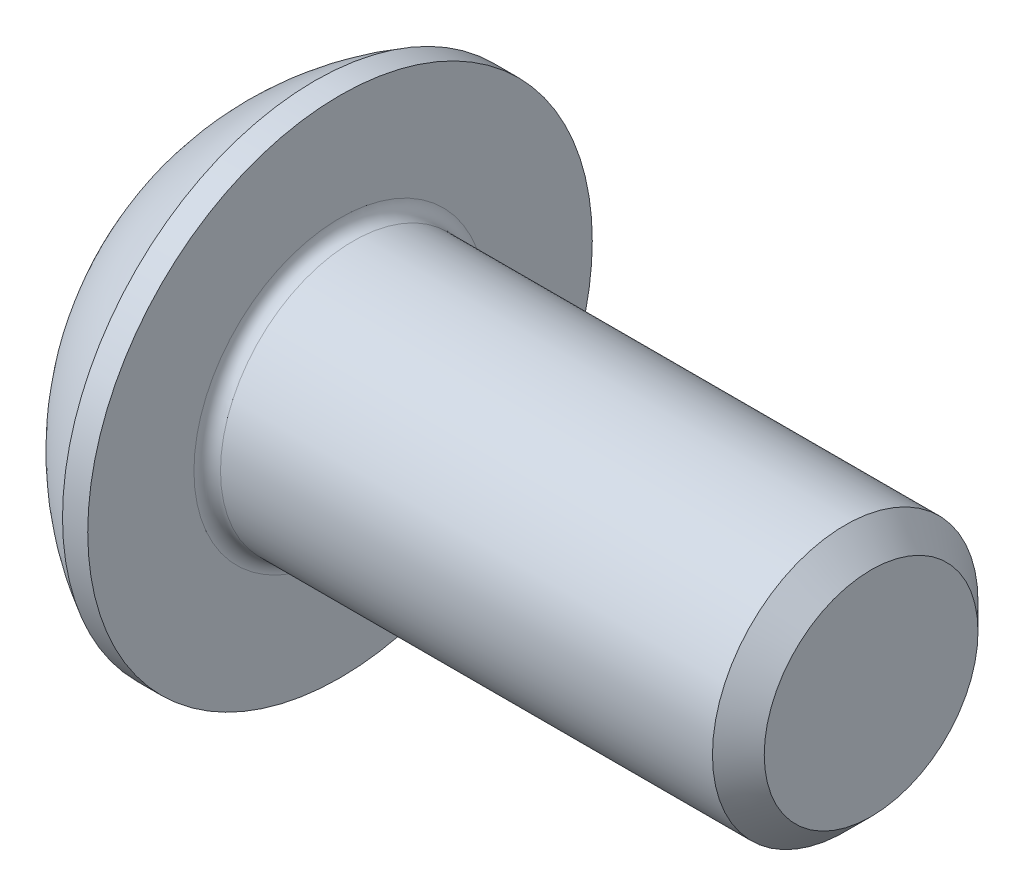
ISO-10303-21;
HEADER;
FILE_DESCRIPTION(('STEP AP214'),'2;1');
FILE_NAME('part.step','',(''),(''),'','','');
FILE_SCHEMA(('AUTOMOTIVE_DESIGN { 1 0 10303 214 1 1 1 1 }'));
ENDSEC;
DATA;
#1=APPLICATION_CONTEXT('core data for automotive mechanical design processes');
#2=APPLICATION_PROTOCOL_DEFINITION('international standard','automotive_design',2000,#1);
#3=PRODUCT_CONTEXT('',#1,'mechanical');
#4=PRODUCT('Part','Part','',(#3));
#5=PRODUCT_RELATED_PRODUCT_CATEGORY('part','',(#4));
#6=PRODUCT_DEFINITION_FORMATION('','',#4);
#7=PRODUCT_DEFINITION_CONTEXT('part definition',#1,'design');
#8=PRODUCT_DEFINITION('design','',#6,#7);
#9=PRODUCT_DEFINITION_SHAPE('','',#8);
#10=(LENGTH_UNIT() NAMED_UNIT(*) SI_UNIT(.MILLI.,.METRE.));
#11=(NAMED_UNIT(*) PLANE_ANGLE_UNIT() SI_UNIT($,.RADIAN.));
#12=(NAMED_UNIT(*) SI_UNIT($,.STERADIAN.) SOLID_ANGLE_UNIT());
#13=UNCERTAINTY_MEASURE_WITH_UNIT(LENGTH_MEASURE(1.E-05),#10,'distance_accuracy_value','');
#14=(GEOMETRIC_REPRESENTATION_CONTEXT(3) GLOBAL_UNCERTAINTY_ASSIGNED_CONTEXT((#13)) GLOBAL_UNIT_ASSIGNED_CONTEXT((#10,
#11,#12)) REPRESENTATION_CONTEXT('',''));
#15=CARTESIAN_POINT('',(0.,0.,0.));
#16=DIRECTION('',(0.,0.,1.));
#17=DIRECTION('',(1.,0.,0.));
#18=AXIS2_PLACEMENT_3D('',#15,#16,#17);
#19=CARTESIAN_POINT('',(0.,0.,0.));
#20=DIRECTION('',(-1.,0.,0.));
#21=DIRECTION('',(0.,0.,1.));
#22=AXIS2_PLACEMENT_3D('',#19,#20,#21);
#23=PLANE('',#22);
#24=CARTESIAN_POINT('',(0.,0.,0.));
#25=DIRECTION('',(-1.,0.,0.));
#26=DIRECTION('',(0.,0.,1.));
#27=AXIS2_PLACEMENT_3D('',#24,#25,#26);
#28=CIRCLE('',#27,1.9);
#29=CARTESIAN_POINT('',(0.,1.9,0.));
#30=VERTEX_POINT('',#29);
#31=EDGE_CURVE('E157',#30,#30,#28,.T.);
#32=ORIENTED_EDGE('',*,*,#31,.T.);
#33=EDGE_LOOP('',(#32));
#34=FACE_BOUND('',#33,.T.);
#35=DIRECTION('',(0.,-1.,0.));
#36=VECTOR('',#35,1.);
#37=CARTESIAN_POINT('',(0.,-0.721687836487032,1.25));
#38=LINE('',#37,#36);
#39=CARTESIAN_POINT('',(0.,0.721687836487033,1.25));
#40=VERTEX_POINT('',#39);
#41=CARTESIAN_POINT('',(0.,-0.721687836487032,1.25));
#42=VERTEX_POINT('',#41);
#43=EDGE_CURVE('E52',#40,#42,#38,.T.);
#44=ORIENTED_EDGE('',*,*,#43,.T.);
#45=DIRECTION('',(0.,-0.5,-0.866025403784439));
#46=VECTOR('',#45,1.);
#47=CARTESIAN_POINT('',(0.,-1.44337567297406,0.));
#48=LINE('',#47,#46);
#49=CARTESIAN_POINT('',(0.,-1.44337567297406,0.));
#50=VERTEX_POINT('',#49);
#51=EDGE_CURVE('E277',#42,#50,#48,.T.);
#52=ORIENTED_EDGE('',*,*,#51,.T.);
#53=DIRECTION('',(0.,0.5,-0.866025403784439));
#54=VECTOR('',#53,1.);
#55=CARTESIAN_POINT('',(0.,-0.721687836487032,-1.25));
#56=LINE('',#55,#54);
#57=CARTESIAN_POINT('',(0.,-0.721687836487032,-1.25));
#58=VERTEX_POINT('',#57);
#59=EDGE_CURVE('E132',#50,#58,#56,.T.);
#60=ORIENTED_EDGE('',*,*,#59,.T.);
#61=DIRECTION('',(0.,1.,0.));
#62=VECTOR('',#61,1.);
#63=CARTESIAN_POINT('',(0.,0.721687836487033,-1.25));
#64=LINE('',#63,#62);
#65=CARTESIAN_POINT('',(0.,0.721687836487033,-1.25));
#66=VERTEX_POINT('',#65);
#67=EDGE_CURVE('E280',#58,#66,#64,.T.);
#68=ORIENTED_EDGE('',*,*,#67,.T.);
#69=DIRECTION('',(0.,0.5,0.866025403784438));
#70=VECTOR('',#69,1.);
#71=CARTESIAN_POINT('',(0.,1.44337567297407,0.));
#72=LINE('',#71,#70);
#73=CARTESIAN_POINT('',(0.,1.44337567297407,0.));
#74=VERTEX_POINT('',#73);
#75=EDGE_CURVE('E282',#66,#74,#72,.T.);
#76=ORIENTED_EDGE('',*,*,#75,.T.);
#77=DIRECTION('',(0.,-0.5,0.866025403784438));
#78=VECTOR('',#77,1.);
#79=CARTESIAN_POINT('',(0.,0.721687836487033,1.25));
#80=LINE('',#79,#78);
#81=EDGE_CURVE('E284',#74,#40,#80,.T.);
#82=ORIENTED_EDGE('',*,*,#81,.T.);
#83=EDGE_LOOP('',(#44,#52,#60,#68,#76,#82));
#84=FACE_BOUND('',#83,.T.);
#85=ADVANCED_FACE('F37',(#34,#84),#23,.T.);
#86=CARTESIAN_POINT('',(3.88527472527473,0.,0.));
#87=DIRECTION('',(-1.,0.,0.));
#88=DIRECTION('',(0.,1.,0.));
#89=AXIS2_PLACEMENT_3D('',#86,#87,#88);
#90=SPHERICAL_SURFACE('',#89,4.32496932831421);
#91=CARTESIAN_POINT('',(1.82,0.,0.));
#92=DIRECTION('',(-1.,0.,0.));
#93=DIRECTION('',(0.,0.,1.));
#94=AXIS2_PLACEMENT_3D('',#91,#92,#93);
#95=CIRCLE('',#94,3.8);
#96=CARTESIAN_POINT('',(1.82,3.8,0.));
#97=VERTEX_POINT('',#96);
#98=EDGE_CURVE('E154',#97,#97,#95,.T.);
#99=CARTESIAN_POINT('',(1.82,3.8,0.));
#100=CARTESIAN_POINT('',(1.79553223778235,3.78670197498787,0.));
#101=CARTESIAN_POINT('',(1.77119294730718,3.77316757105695,0.));
#102=CARTESIAN_POINT('',(1.72278031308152,3.74563119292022,0.));
#103=CARTESIAN_POINT('',(1.69870696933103,3.7316292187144,0.));
#104=CARTESIAN_POINT('',(1.65083523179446,3.7031628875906,0.));
#105=CARTESIAN_POINT('',(1.62703683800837,3.6886985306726,0.));
#106=CARTESIAN_POINT('',(1.57972387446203,3.65931284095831,0.));
#107=CARTESIAN_POINT('',(1.55620930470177,3.64439150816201,0.));
#108=CARTESIAN_POINT('',(1.50947276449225,3.61409743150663,0.));
#109=CARTESIAN_POINT('',(1.48625079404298,3.59872468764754,0.));
#110=CARTESIAN_POINT('',(1.44010811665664,3.56753352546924,0.));
#111=CARTESIAN_POINT('',(1.41718740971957,3.55171510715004,0.));
#112=CARTESIAN_POINT('',(1.37165581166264,3.51963849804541,0.));
#113=CARTESIAN_POINT('',(1.34904492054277,3.50338030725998,0.));
#114=CARTESIAN_POINT('',(1.30414139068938,3.47043021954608,0.));
#115=CARTESIAN_POINT('',(1.28184875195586,3.4537383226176,0.));
#116=CARTESIAN_POINT('',(1.23759004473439,3.41992705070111,0.));
#117=CARTESIAN_POINT('',(1.21562397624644,3.40280767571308,0.));
#118=CARTESIAN_POINT('',(1.17202660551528,3.3681478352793,0.));
#119=CARTESIAN_POINT('',(1.15039530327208,3.35060736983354,0.));
#120=CARTESIAN_POINT('',(1.10747553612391,3.31511189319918,0.));
#121=CARTESIAN_POINT('',(1.08618707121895,3.29715688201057,0.));
#122=CARTESIAN_POINT('',(1.04396092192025,3.26083901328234,0.));
#123=CARTESIAN_POINT('',(1.02302323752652,3.24247615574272,0.));
#124=CARTESIAN_POINT('',(0.981506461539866,3.20534944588,0.));
#125=CARTESIAN_POINT('',(0.960927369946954,3.18658559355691,0.));
#126=CARTESIAN_POINT('',(0.920135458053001,3.14866389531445,0.));
#127=CARTESIAN_POINT('',(0.89992263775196,3.12950604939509,0.));
#128=CARTESIAN_POINT('',(0.859870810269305,3.09080351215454,0.));
#129=CARTESIAN_POINT('',(0.840031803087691,3.07125882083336,0.));
#130=CARTESIAN_POINT('',(0.800735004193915,3.0317898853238,0.));
#131=CARTESIAN_POINT('',(0.781277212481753,3.01186564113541,0.));
#132=CARTESIAN_POINT('',(0.742750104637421,2.97164503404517,0.));
#133=CARTESIAN_POINT('',(0.723680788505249,2.95134867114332,0.));
#134=CARTESIAN_POINT('',(0.685937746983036,2.91039139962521,0.));
#135=CARTESIAN_POINT('',(0.667264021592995,2.88973049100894,0.));
#136=CARTESIAN_POINT('',(0.630319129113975,2.84805183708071,0.));
#137=CARTESIAN_POINT('',(0.612047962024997,2.82703409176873,0.));
#138=CARTESIAN_POINT('',(0.575915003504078,2.78464960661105,0.));
#139=CARTESIAN_POINT('',(0.558053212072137,2.76328286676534,0.));
#140=CARTESIAN_POINT('',(0.52274566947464,2.72020836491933,0.));
#141=CARTESIAN_POINT('',(0.505299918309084,2.69850060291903,0.));
#142=CARTESIAN_POINT('',(0.470830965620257,2.65475215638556,0.));
#143=CARTESIAN_POINT('',(0.453807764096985,2.63271147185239,0.));
#144=CARTESIAN_POINT('',(0.420190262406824,2.58830540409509,0.));
#145=CARTESIAN_POINT('',(0.403595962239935,2.56594002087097,0.));
#146=CARTESIAN_POINT('',(0.370842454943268,2.52089290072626,0.));
#147=CARTESIAN_POINT('',(0.35468324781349,2.49821116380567,0.));
#148=CARTESIAN_POINT('',(0.322805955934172,2.45253979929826,0.));
#149=CARTESIAN_POINT('',(0.307087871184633,2.42955017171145,0.));
#150=CARTESIAN_POINT('',(0.276098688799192,2.38327160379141,0.));
#151=CARTESIAN_POINT('',(0.260827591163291,2.35998266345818,0.));
#152=CARTESIAN_POINT('',(0.230738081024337,2.31311415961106,0.));
#153=CARTESIAN_POINT('',(0.215919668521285,2.28953459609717,0.));
#154=CARTESIAN_POINT('',(0.186741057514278,2.24209364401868,0.));
#155=CARTESIAN_POINT('',(0.172380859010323,2.21823225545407,0.));
#156=CARTESIAN_POINT('',(0.14412403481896,2.17023655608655,0.));
#157=CARTESIAN_POINT('',(0.130227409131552,2.14610224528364,0.));
#158=CARTESIAN_POINT('',(0.102902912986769,2.09756970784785,0.));
#159=CARTESIAN_POINT('',(0.0894750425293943,2.07317148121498,0.));
#160=CARTESIAN_POINT('',(0.0630930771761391,2.02412021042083,0.));
#161=CARTESIAN_POINT('',(0.0501389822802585,1.99946716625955,0.));
#162=CARTESIAN_POINT('',(0.0247093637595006,1.94991547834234,0.));
#163=CARTESIAN_POINT('',(0.0122338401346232,1.9250168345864,0.));
#164=CARTESIAN_POINT('',(0.,1.9,0.));
#165=B_SPLINE_CURVE_WITH_KNOTS('',3,(#99,#100,#101,#102,#103,#104,#105,#106,#107,#108,#109,#110,
#111,#112,#113,#114,#115,#116,#117,#118,#119,#120,#121,#122,#123,#124,#125,#126,#127,#128,#129,
#130,#131,#132,#133,#134,#135,#136,#137,#138,#139,#140,#141,#142,#143,#144,#145,#146,#147,#148,
#149,#150,#151,#152,#153,#154,#155,#156,#157,#158,#159,#160,#161,#162,#163,#164),.UNSPECIFIED.,
.F.,.F.,(4,2,2,2,2,2,2,2,2,2,2,2,2,2,2,2,2,2,2,2,2,2,2,2,2,2,2,2,2,2,2,2,4),(0.,
0.0835425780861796,0.167085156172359,0.250627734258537,0.334170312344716,0.417712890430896,
0.501255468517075,0.584798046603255,0.668340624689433,0.751883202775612,0.835425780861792,
0.91896835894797,1.00251093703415,1.08605351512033,1.16959609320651,1.25313867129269,
1.33668124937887,1.42022382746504,1.50376640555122,1.5873089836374,1.67085156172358,
1.75439413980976,1.83793671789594,1.92147929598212,2.0050218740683,2.08856445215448,
2.17210703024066,2.25564960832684,2.33919218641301,2.42273476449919,2.50627734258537,
2.58981992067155,2.67336249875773),.UNSPECIFIED.);
#166=EDGE_CURVE('BSEAM178',#97,#30,#165,.T.);
#167=ORIENTED_EDGE('',*,*,#98,.T.);
#168=ORIENTED_EDGE('',*,*,#31,.F.);
#169=ORIENTED_EDGE('',*,*,#166,.T.);
#170=ORIENTED_EDGE('',*,*,#166,.F.);
#171=EDGE_LOOP('',(#167,#169,#168,#170));
#172=FACE_BOUND('',#171,.T.);
#173=ADVANCED_FACE('F178',(#172),#90,.T.);
#174=CARTESIAN_POINT('',(0.,0.,0.));
#175=DIRECTION('',(-1.,0.,0.));
#176=DIRECTION('',(0.,0.,1.));
#177=AXIS2_PLACEMENT_3D('',#174,#175,#176);
#178=CYLINDRICAL_SURFACE('',#177,3.8);
#179=ORIENTED_EDGE('',*,*,#98,.F.);
#180=EDGE_LOOP('',(#179));
#181=FACE_BOUND('',#180,.T.);
#182=CARTESIAN_POINT('',(2.2,0.,0.));
#183=DIRECTION('',(-1.,0.,0.));
#184=DIRECTION('',(0.,0.,1.));
#185=AXIS2_PLACEMENT_3D('',#182,#183,#184);
#186=CIRCLE('',#185,3.8);
#187=CARTESIAN_POINT('',(2.2,0.,3.8));
#188=VERTEX_POINT('',#187);
#189=EDGE_CURVE('E151',#188,#188,#186,.T.);
#190=ORIENTED_EDGE('',*,*,#189,.T.);
#191=EDGE_LOOP('',(#190));
#192=FACE_BOUND('',#191,.T.);
#193=ADVANCED_FACE('F183',(#181,#192),#178,.T.);
#194=CARTESIAN_POINT('',(2.2,2.,0.));
#195=DIRECTION('',(-1.,0.,0.));
#196=DIRECTION('',(0.,0.,1.));
#197=AXIS2_PLACEMENT_3D('',#194,#195,#196);
#198=PLANE('',#197);
#199=CARTESIAN_POINT('',(2.2,0.,0.));
#200=DIRECTION('',(-1.,0.,0.));
#201=DIRECTION('',(0.,0.,1.));
#202=AXIS2_PLACEMENT_3D('',#199,#200,#201);
#203=CIRCLE('',#202,2.2);
#204=CARTESIAN_POINT('',(2.2,0.,2.2));
#205=VERTEX_POINT('',#204);
#206=EDGE_CURVE('E45',#205,#205,#203,.T.);
#207=ORIENTED_EDGE('',*,*,#206,.T.);
#208=EDGE_LOOP('',(#207));
#209=FACE_BOUND('',#208,.T.);
#210=ORIENTED_EDGE('',*,*,#189,.F.);
#211=EDGE_LOOP('',(#210));
#212=FACE_BOUND('',#211,.T.);
#213=ADVANCED_FACE('F162',(#209,#212),#198,.F.);
#214=CARTESIAN_POINT('',(0.,0.,0.));
#215=DIRECTION('',(-1.,0.,0.));
#216=DIRECTION('',(0.,0.,1.));
#217=AXIS2_PLACEMENT_3D('',#214,#215,#216);
#218=CYLINDRICAL_SURFACE('',#217,2.);
#219=CARTESIAN_POINT('',(2.4,0.,0.));
#220=DIRECTION('',(-1.,0.,0.));
#221=DIRECTION('',(0.,0.,1.));
#222=AXIS2_PLACEMENT_3D('',#219,#220,#221);
#223=CIRCLE('',#222,2.);
#224=CARTESIAN_POINT('',(2.4,0.,2.));
#225=VERTEX_POINT('',#224);
#226=EDGE_CURVE('E11',#225,#225,#223,.F.);
#227=ORIENTED_EDGE('',*,*,#226,.T.);
#228=EDGE_LOOP('',(#227));
#229=FACE_BOUND('',#228,.T.);
#230=CARTESIAN_POINT('',(9.81000000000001,0.,0.));
#231=DIRECTION('',(-1.,0.,0.));
#232=DIRECTION('',(0.,0.,1.));
#233=AXIS2_PLACEMENT_3D('',#230,#231,#232);
#234=CIRCLE('',#233,2.);
#235=CARTESIAN_POINT('',(9.81000000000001,0.,2.));
#236=VERTEX_POINT('',#235);
#237=EDGE_CURVE('E148',#236,#236,#234,.T.);
#238=ORIENTED_EDGE('',*,*,#237,.T.);
#239=EDGE_LOOP('',(#238));
#240=FACE_BOUND('',#239,.T.);
#241=ADVANCED_FACE('F192',(#229,#240),#218,.T.);
#242=CARTESIAN_POINT('',(10.2,0.,0.));
#243=DIRECTION('',(-1.,0.,0.));
#244=DIRECTION('',(0.,0.,1.));
#245=AXIS2_PLACEMENT_3D('',#242,#243,#244);
#246=CONICAL_SURFACE('',#245,1.61,0.785398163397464);
#247=ORIENTED_EDGE('',*,*,#237,.F.);
#248=EDGE_LOOP('',(#247));
#249=FACE_BOUND('',#248,.T.);
#250=CARTESIAN_POINT('',(10.2,0.,0.));
#251=DIRECTION('',(-1.,0.,0.));
#252=DIRECTION('',(0.,0.,1.));
#253=AXIS2_PLACEMENT_3D('',#250,#251,#252);
#254=CIRCLE('',#253,1.61);
#255=CARTESIAN_POINT('',(10.2,0.,1.61));
#256=VERTEX_POINT('',#255);
#257=EDGE_CURVE('E144',#256,#256,#254,.T.);
#258=ORIENTED_EDGE('',*,*,#257,.T.);
#259=EDGE_LOOP('',(#258));
#260=FACE_BOUND('',#259,.T.);
#261=ADVANCED_FACE('F173',(#249,#260),#246,.T.);
#262=CARTESIAN_POINT('',(10.2,0.,0.));
#263=DIRECTION('',(-1.,0.,0.));
#264=DIRECTION('',(0.,0.,1.));
#265=AXIS2_PLACEMENT_3D('',#262,#263,#264);
#266=PLANE('',#265);
#267=ORIENTED_EDGE('',*,*,#257,.F.);
#268=EDGE_LOOP('',(#267));
#269=FACE_BOUND('',#268,.T.);
#270=ADVANCED_FACE('F166',(#269),#266,.F.);
#271=CARTESIAN_POINT('',(2.4,0.,0.));
#272=DIRECTION('',(-1.,0.,0.));
#273=DIRECTION('',(0.,0.,1.));
#274=AXIS2_PLACEMENT_3D('',#271,#272,#273);
#275=TOROIDAL_SURFACE('',#274,2.2,0.2);
#276=ORIENTED_EDGE('',*,*,#226,.F.);
#277=EDGE_LOOP('',(#276));
#278=FACE_BOUND('',#277,.T.);
#279=ORIENTED_EDGE('',*,*,#206,.F.);
#280=EDGE_LOOP('',(#279));
#281=FACE_BOUND('',#280,.T.);
#282=ADVANCED_FACE('F39',(#278,#281),#275,.F.);
#283=CARTESIAN_POINT('',(1.3,-1.44337567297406,0.));
#284=DIRECTION('',(0.,0.866025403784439,-0.5));
#285=DIRECTION('',(0.,0.5,0.866025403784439));
#286=AXIS2_PLACEMENT_3D('',#283,#284,#285);
#287=PLANE('',#286);
#288=DIRECTION('',(0.,-0.5,-0.866025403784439));
#289=VECTOR('',#288,1.);
#290=CARTESIAN_POINT('',(1.3,-1.44337567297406,0.));
#291=LINE('',#290,#289);
#292=CARTESIAN_POINT('',(1.3,-0.721687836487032,1.25));
#293=VERTEX_POINT('',#292);
#294=CARTESIAN_POINT('',(1.3,-1.08253175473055,0.624999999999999));
#295=VERTEX_POINT('',#294);
#296=EDGE_CURVE('E118',#293,#295,#291,.T.);
#297=ORIENTED_EDGE('',*,*,#296,.T.);
#298=CARTESIAN_POINT('',(1.3,-1.44337567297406,0.));
#299=VERTEX_POINT('',#298);
#300=EDGE_CURVE('E113',#295,#299,#291,.T.);
#301=ORIENTED_EDGE('',*,*,#300,.T.);
#302=DIRECTION('',(-1.,0.,0.));
#303=VECTOR('',#302,1.);
#304=CARTESIAN_POINT('',(1.3,-1.44337567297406,0.));
#305=LINE('',#304,#303);
#306=EDGE_CURVE('E115',#299,#50,#305,.T.);
#307=ORIENTED_EDGE('',*,*,#306,.T.);
#308=ORIENTED_EDGE('',*,*,#51,.F.);
#309=DIRECTION('',(-1.,0.,0.));
#310=VECTOR('',#309,1.);
#311=CARTESIAN_POINT('',(1.3,-0.721687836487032,1.25));
#312=LINE('',#311,#310);
#313=EDGE_CURVE('E273',#293,#42,#312,.T.);
#314=ORIENTED_EDGE('',*,*,#313,.F.);
#315=EDGE_LOOP('',(#297,#301,#307,#308,#314));
#316=FACE_BOUND('',#315,.T.);
#317=ADVANCED_FACE('F114',(#316),#287,.T.);
#318=CARTESIAN_POINT('',(1.3,-0.721687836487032,-1.25));
#319=DIRECTION('',(0.,0.866025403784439,0.5));
#320=DIRECTION('',(0.,-0.5,0.866025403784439));
#321=AXIS2_PLACEMENT_3D('',#318,#319,#320);
#322=PLANE('',#321);
#323=DIRECTION('',(0.,0.5,-0.866025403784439));
#324=VECTOR('',#323,1.);
#325=CARTESIAN_POINT('',(1.3,-0.721687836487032,-1.25));
#326=LINE('',#325,#324);
#327=CARTESIAN_POINT('',(1.3,-1.08253175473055,-0.625));
#328=VERTEX_POINT('',#327);
#329=EDGE_CURVE('E60',#299,#328,#326,.T.);
#330=ORIENTED_EDGE('',*,*,#329,.T.);
#331=CARTESIAN_POINT('',(1.3,-0.721687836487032,-1.25));
#332=VERTEX_POINT('',#331);
#333=EDGE_CURVE('E127',#328,#332,#326,.T.);
#334=ORIENTED_EDGE('',*,*,#333,.T.);
#335=DIRECTION('',(-1.,0.,0.));
#336=VECTOR('',#335,1.);
#337=CARTESIAN_POINT('',(1.3,-0.721687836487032,-1.25));
#338=LINE('',#337,#336);
#339=EDGE_CURVE('E134',#332,#58,#338,.T.);
#340=ORIENTED_EDGE('',*,*,#339,.T.);
#341=ORIENTED_EDGE('',*,*,#59,.F.);
#342=ORIENTED_EDGE('',*,*,#306,.F.);
#343=EDGE_LOOP('',(#330,#334,#340,#341,#342));
#344=FACE_BOUND('',#343,.T.);
#345=ADVANCED_FACE('F130',(#344),#322,.T.);
#346=CARTESIAN_POINT('',(1.3,0.721687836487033,-1.25));
#347=DIRECTION('',(0.,0.,1.));
#348=DIRECTION('',(1.,0.,0.));
#349=AXIS2_PLACEMENT_3D('',#346,#347,#348);
#350=PLANE('',#349);
#351=DIRECTION('',(0.,1.,0.));
#352=VECTOR('',#351,1.);
#353=CARTESIAN_POINT('',(1.3,0.721687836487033,-1.25));
#354=LINE('',#353,#352);
#355=CARTESIAN_POINT('',(1.3,0.,-1.25));
#356=VERTEX_POINT('',#355);
#357=EDGE_CURVE('E254',#332,#356,#354,.T.);
#358=ORIENTED_EDGE('',*,*,#357,.T.);
#359=CARTESIAN_POINT('',(1.3,0.721687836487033,-1.25));
#360=VERTEX_POINT('',#359);
#361=EDGE_CURVE('E126',#356,#360,#354,.T.);
#362=ORIENTED_EDGE('',*,*,#361,.T.);
#363=DIRECTION('',(-1.,0.,0.));
#364=VECTOR('',#363,1.);
#365=CARTESIAN_POINT('',(1.3,0.721687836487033,-1.25));
#366=LINE('',#365,#364);
#367=EDGE_CURVE('E139',#360,#66,#366,.T.);
#368=ORIENTED_EDGE('',*,*,#367,.T.);
#369=ORIENTED_EDGE('',*,*,#67,.F.);
#370=ORIENTED_EDGE('',*,*,#339,.F.);
#371=EDGE_LOOP('',(#358,#362,#368,#369,#370));
#372=FACE_BOUND('',#371,.T.);
#373=ADVANCED_FACE('F206',(#372),#350,.T.);
#374=CARTESIAN_POINT('',(1.3,1.44337567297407,0.));
#375=DIRECTION('',(0.,-0.866025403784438,0.5));
#376=DIRECTION('',(0.,-0.5,-0.866025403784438));
#377=AXIS2_PLACEMENT_3D('',#374,#375,#376);
#378=PLANE('',#377);
#379=DIRECTION('',(0.,0.5,0.866025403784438));
#380=VECTOR('',#379,1.);
#381=CARTESIAN_POINT('',(1.3,1.44337567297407,0.));
#382=LINE('',#381,#380);
#383=CARTESIAN_POINT('',(1.3,1.08253175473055,-0.625000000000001));
#384=VERTEX_POINT('',#383);
#385=EDGE_CURVE('E243',#360,#384,#382,.T.);
#386=ORIENTED_EDGE('',*,*,#385,.T.);
#387=CARTESIAN_POINT('',(1.3,1.44337567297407,0.));
#388=VERTEX_POINT('',#387);
#389=EDGE_CURVE('E248',#384,#388,#382,.T.);
#390=ORIENTED_EDGE('',*,*,#389,.T.);
#391=DIRECTION('',(-1.,0.,0.));
#392=VECTOR('',#391,1.);
#393=CARTESIAN_POINT('',(1.3,1.44337567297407,0.));
#394=LINE('',#393,#392);
#395=EDGE_CURVE('E288',#388,#74,#394,.T.);
#396=ORIENTED_EDGE('',*,*,#395,.T.);
#397=ORIENTED_EDGE('',*,*,#75,.F.);
#398=ORIENTED_EDGE('',*,*,#367,.F.);
#399=EDGE_LOOP('',(#386,#390,#396,#397,#398));
#400=FACE_BOUND('',#399,.T.);
#401=ADVANCED_FACE('F209',(#400),#378,.T.);
#402=CARTESIAN_POINT('',(1.3,0.721687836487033,1.25));
#403=DIRECTION('',(0.,-0.866025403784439,-0.5));
#404=DIRECTION('',(0.,0.5,-0.866025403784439));
#405=AXIS2_PLACEMENT_3D('',#402,#403,#404);
#406=PLANE('',#405);
#407=DIRECTION('',(0.,-0.5,0.866025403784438));
#408=VECTOR('',#407,1.);
#409=CARTESIAN_POINT('',(1.3,0.721687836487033,1.25));
#410=LINE('',#409,#408);
#411=CARTESIAN_POINT('',(1.3,1.08253175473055,0.625000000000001));
#412=VERTEX_POINT('',#411);
#413=EDGE_CURVE('E251',#388,#412,#410,.T.);
#414=ORIENTED_EDGE('',*,*,#413,.T.);
#415=CARTESIAN_POINT('',(1.3,0.721687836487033,1.25));
#416=VERTEX_POINT('',#415);
#417=EDGE_CURVE('E259',#412,#416,#410,.T.);
#418=ORIENTED_EDGE('',*,*,#417,.T.);
#419=DIRECTION('',(-1.,0.,0.));
#420=VECTOR('',#419,1.);
#421=CARTESIAN_POINT('',(1.3,0.721687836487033,1.25));
#422=LINE('',#421,#420);
#423=EDGE_CURVE('E272',#416,#40,#422,.T.);
#424=ORIENTED_EDGE('',*,*,#423,.T.);
#425=ORIENTED_EDGE('',*,*,#81,.F.);
#426=ORIENTED_EDGE('',*,*,#395,.F.);
#427=EDGE_LOOP('',(#414,#418,#424,#425,#426));
#428=FACE_BOUND('',#427,.T.);
#429=ADVANCED_FACE('F213',(#428),#406,.T.);
#430=CARTESIAN_POINT('',(1.3,-0.721687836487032,1.25));
#431=DIRECTION('',(0.,0.,-1.));
#432=DIRECTION('',(0.,1.,0.));
#433=AXIS2_PLACEMENT_3D('',#430,#431,#432);
#434=PLANE('',#433);
#435=DIRECTION('',(0.,-1.,0.));
#436=VECTOR('',#435,1.);
#437=CARTESIAN_POINT('',(1.3,-0.721687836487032,1.25));
#438=LINE('',#437,#436);
#439=CARTESIAN_POINT('',(1.3,0.,1.25));
#440=VERTEX_POINT('',#439);
#441=EDGE_CURVE('E265',#416,#440,#438,.T.);
#442=ORIENTED_EDGE('',*,*,#441,.T.);
#443=EDGE_CURVE('E267',#440,#293,#438,.T.);
#444=ORIENTED_EDGE('',*,*,#443,.T.);
#445=ORIENTED_EDGE('',*,*,#313,.T.);
#446=ORIENTED_EDGE('',*,*,#43,.F.);
#447=ORIENTED_EDGE('',*,*,#423,.F.);
#448=EDGE_LOOP('',(#442,#444,#445,#446,#447));
#449=FACE_BOUND('',#448,.T.);
#450=ADVANCED_FACE('F217',(#449),#434,.T.);
#451=CARTESIAN_POINT('',(1.3,-2.1650635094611,-1.25));
#452=DIRECTION('',(1.,0.,0.));
#453=DIRECTION('',(0.,0.,-1.));
#454=AXIS2_PLACEMENT_3D('',#451,#452,#453);
#455=PLANE('',#454);
#456=CARTESIAN_POINT('',(1.3,0.,0.));
#457=DIRECTION('',(-1.,0.,0.));
#458=DIRECTION('',(0.,0.,1.));
#459=AXIS2_PLACEMENT_3D('',#456,#457,#458);
#460=CIRCLE('',#459,1.25);
#461=EDGE_CURVE('E240',#384,#356,#460,.T.);
#462=ORIENTED_EDGE('',*,*,#461,.F.);
#463=ORIENTED_EDGE('',*,*,#385,.F.);
#464=ORIENTED_EDGE('',*,*,#361,.F.);
#465=EDGE_LOOP('',(#462,#463,#464));
#466=FACE_BOUND('',#465,.T.);
#467=ADVANCED_FACE('F221',(#466),#455,.F.);
#468=EDGE_CURVE('E145',#412,#384,#460,.T.);
#469=ORIENTED_EDGE('',*,*,#468,.F.);
#470=ORIENTED_EDGE('',*,*,#413,.F.);
#471=ORIENTED_EDGE('',*,*,#389,.F.);
#472=EDGE_LOOP('',(#469,#470,#471));
#473=FACE_BOUND('',#472,.T.);
#474=ADVANCED_FACE('F230',(#473),#455,.F.);
#475=EDGE_CURVE('E138',#440,#412,#460,.T.);
#476=ORIENTED_EDGE('',*,*,#475,.F.);
#477=ORIENTED_EDGE('',*,*,#441,.F.);
#478=ORIENTED_EDGE('',*,*,#417,.F.);
#479=EDGE_LOOP('',(#476,#477,#478));
#480=FACE_BOUND('',#479,.T.);
#481=ADVANCED_FACE('F235',(#480),#455,.F.);
#482=EDGE_CURVE('E133',#295,#440,#460,.T.);
#483=ORIENTED_EDGE('',*,*,#482,.F.);
#484=ORIENTED_EDGE('',*,*,#296,.F.);
#485=ORIENTED_EDGE('',*,*,#443,.F.);
#486=EDGE_LOOP('',(#483,#484,#485));
#487=FACE_BOUND('',#486,.T.);
#488=ADVANCED_FACE('F228',(#487),#455,.F.);
#489=EDGE_CURVE('E124',#328,#295,#460,.T.);
#490=ORIENTED_EDGE('',*,*,#489,.F.);
#491=ORIENTED_EDGE('',*,*,#329,.F.);
#492=ORIENTED_EDGE('',*,*,#300,.F.);
#493=EDGE_LOOP('',(#490,#491,#492));
#494=FACE_BOUND('',#493,.T.);
#495=ADVANCED_FACE('F123',(#494),#455,.F.);
#496=EDGE_CURVE('E246',#356,#328,#460,.T.);
#497=ORIENTED_EDGE('',*,*,#496,.F.);
#498=ORIENTED_EDGE('',*,*,#357,.F.);
#499=ORIENTED_EDGE('',*,*,#333,.F.);
#500=EDGE_LOOP('',(#497,#498,#499));
#501=FACE_BOUND('',#500,.T.);
#502=ADVANCED_FACE('F201',(#501),#455,.F.);
#503=CARTESIAN_POINT('',(2.02168783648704,0.,0.));
#504=DIRECTION('',(-1.,0.,0.));
#505=DIRECTION('',(0.,0.,1.));
#506=AXIS2_PLACEMENT_3D('',#503,#504,#505);
#507=CONICAL_SURFACE('',#506,0.,1.04719755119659);
#508=ORIENTED_EDGE('',*,*,#475,.T.);
#509=ORIENTED_EDGE('',*,*,#468,.T.);
#510=ORIENTED_EDGE('',*,*,#461,.T.);
#511=ORIENTED_EDGE('',*,*,#496,.T.);
#512=ORIENTED_EDGE('',*,*,#489,.T.);
#513=ORIENTED_EDGE('',*,*,#482,.T.);
#514=EDGE_LOOP('',(#508,#509,#510,#511,#512,#513));
#515=FACE_BOUND('',#514,.T.);
#516=CARTESIAN_POINT('',(2.02168783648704,0.,0.));
#517=VERTEX_POINT('',#516);
#518=VERTEX_LOOP('',#517);
#519=FACE_BOUND('',#518,.T.);
#520=ADVANCED_FACE('F199',(#515,#519),#507,.F.);
#521=CLOSED_SHELL('',(#85,#173,#193,#213,#241,#261,#270,#282,#317,#345,#373,#401,#429,#450,#467,
#474,#481,#488,#495,#502,#520));
#522=MANIFOLD_SOLID_BREP('B2',#521);
#523=ADVANCED_BREP_SHAPE_REPRESENTATION('',(#18,#522),#14);
#524=SHAPE_DEFINITION_REPRESENTATION(#9,#523);
ENDSEC;
END-ISO-10303-21;
